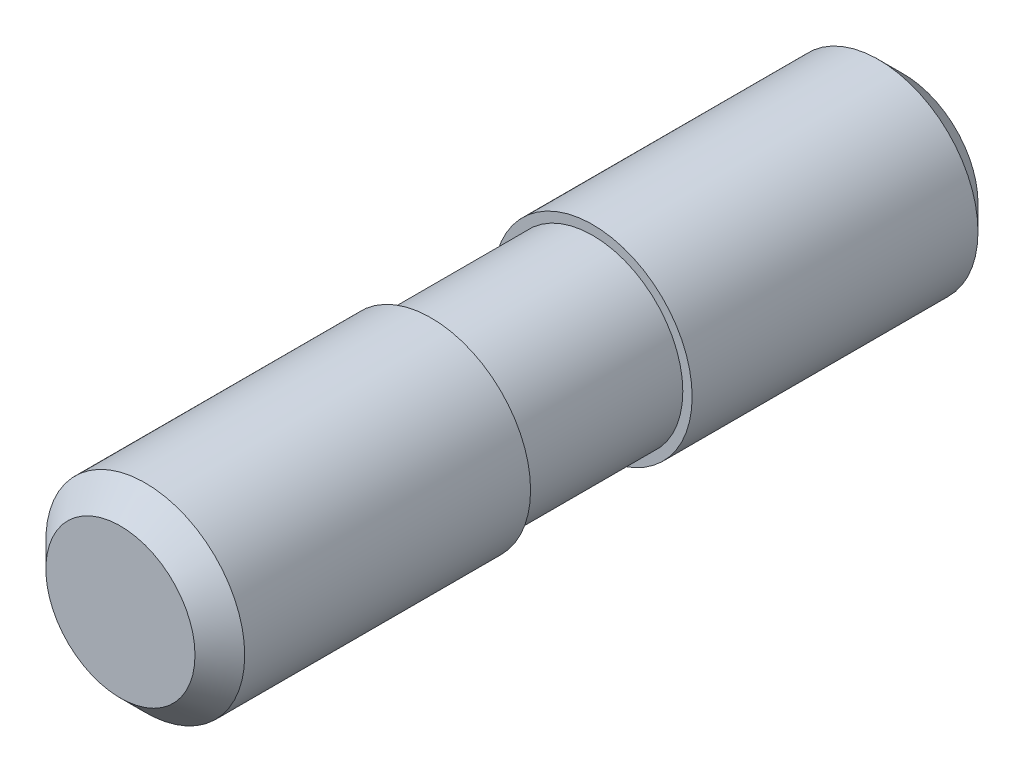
ISO-10303-21;
HEADER;
FILE_DESCRIPTION(('STEP AP214'),'2;1');
FILE_NAME('part.step','',(''),(''),'','','');
FILE_SCHEMA(('AUTOMOTIVE_DESIGN { 1 0 10303 214 1 1 1 1 }'));
ENDSEC;
DATA;
#1=APPLICATION_CONTEXT('core data for automotive mechanical design processes');
#2=APPLICATION_PROTOCOL_DEFINITION('international standard','automotive_design',2000,#1);
#3=PRODUCT_CONTEXT('',#1,'mechanical');
#4=PRODUCT('Part','Part','',(#3));
#5=PRODUCT_RELATED_PRODUCT_CATEGORY('part','',(#4));
#6=PRODUCT_DEFINITION_FORMATION('','',#4);
#7=PRODUCT_DEFINITION_CONTEXT('part definition',#1,'design');
#8=PRODUCT_DEFINITION('design','',#6,#7);
#9=PRODUCT_DEFINITION_SHAPE('','',#8);
#10=(LENGTH_UNIT() NAMED_UNIT(*) SI_UNIT(.MILLI.,.METRE.));
#11=(NAMED_UNIT(*) PLANE_ANGLE_UNIT() SI_UNIT($,.RADIAN.));
#12=(NAMED_UNIT(*) SI_UNIT($,.STERADIAN.) SOLID_ANGLE_UNIT());
#13=UNCERTAINTY_MEASURE_WITH_UNIT(LENGTH_MEASURE(1.E-05),#10,'distance_accuracy_value','');
#14=(GEOMETRIC_REPRESENTATION_CONTEXT(3) GLOBAL_UNCERTAINTY_ASSIGNED_CONTEXT((#13)) GLOBAL_UNIT_ASSIGNED_CONTEXT((#10,
#11,#12)) REPRESENTATION_CONTEXT('',''));
#15=CARTESIAN_POINT('',(0.,0.,0.));
#16=DIRECTION('',(0.,0.,1.));
#17=DIRECTION('',(1.,0.,0.));
#18=AXIS2_PLACEMENT_3D('',#15,#16,#17);
#19=CARTESIAN_POINT('',(0.,0.,0.));
#20=DIRECTION('',(0.,0.,1.));
#21=DIRECTION('',(1.,0.,0.));
#22=AXIS2_PLACEMENT_3D('',#19,#20,#21);
#23=PLANE('',#22);
#24=CARTESIAN_POINT('',(0.,0.,0.));
#25=DIRECTION('',(0.,0.,1.));
#26=DIRECTION('',(1.,0.,0.));
#27=AXIS2_PLACEMENT_3D('',#24,#25,#26);
#28=CIRCLE('',#27,6.);
#29=CARTESIAN_POINT('',(6.,0.,0.));
#30=VERTEX_POINT('',#29);
#31=EDGE_CURVE('E8',#30,#30,#28,.T.);
#32=ORIENTED_EDGE('',*,*,#31,.F.);
#33=EDGE_LOOP('',(#32));
#34=FACE_BOUND('',#33,.T.);
#35=ADVANCED_FACE('F12',(#34),#23,.F.);
#36=CARTESIAN_POINT('',(0.,0.,2.));
#37=DIRECTION('',(0.,0.,1.));
#38=DIRECTION('',(1.,0.,0.));
#39=AXIS2_PLACEMENT_3D('',#36,#37,#38);
#40=CONICAL_SURFACE('',#39,8.,0.785398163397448);
#41=ORIENTED_EDGE('',*,*,#31,.T.);
#42=EDGE_LOOP('',(#41));
#43=FACE_BOUND('',#42,.T.);
#44=CARTESIAN_POINT('',(0.,0.,2.));
#45=DIRECTION('',(0.,0.,1.));
#46=DIRECTION('',(1.,0.,0.));
#47=AXIS2_PLACEMENT_3D('',#44,#45,#46);
#48=CIRCLE('',#47,8.);
#49=CARTESIAN_POINT('',(8.,0.,2.));
#50=VERTEX_POINT('',#49);
#51=EDGE_CURVE('E18',#50,#50,#48,.T.);
#52=ORIENTED_EDGE('',*,*,#51,.F.);
#53=EDGE_LOOP('',(#52));
#54=FACE_BOUND('',#53,.T.);
#55=ADVANCED_FACE('F61',(#43,#54),#40,.T.);
#56=CARTESIAN_POINT('',(0.,0.,70.));
#57=DIRECTION('',(0.,0.,1.));
#58=DIRECTION('',(1.,0.,0.));
#59=AXIS2_PLACEMENT_3D('',#56,#57,#58);
#60=CYLINDRICAL_SURFACE('',#59,8.);
#61=CARTESIAN_POINT('',(0.,0.,25.));
#62=DIRECTION('',(0.,0.,1.));
#63=DIRECTION('',(1.,0.,0.));
#64=AXIS2_PLACEMENT_3D('',#61,#62,#63);
#65=CIRCLE('',#64,8.);
#66=CARTESIAN_POINT('',(8.,0.,25.));
#67=VERTEX_POINT('',#66);
#68=EDGE_CURVE('E22',#67,#67,#65,.T.);
#69=ORIENTED_EDGE('',*,*,#68,.F.);
#70=EDGE_LOOP('',(#69));
#71=FACE_BOUND('',#70,.T.);
#72=ORIENTED_EDGE('',*,*,#51,.T.);
#73=EDGE_LOOP('',(#72));
#74=FACE_BOUND('',#73,.T.);
#75=ADVANCED_FACE('F66',(#71,#74),#60,.T.);
#76=CARTESIAN_POINT('',(8.,0.,25.));
#77=DIRECTION('',(0.,0.,-1.));
#78=DIRECTION('',(-1.,0.,0.));
#79=AXIS2_PLACEMENT_3D('',#76,#77,#78);
#80=PLANE('',#79);
#81=CARTESIAN_POINT('',(0.,0.,25.));
#82=DIRECTION('',(0.,0.,1.));
#83=DIRECTION('',(1.,0.,0.));
#84=AXIS2_PLACEMENT_3D('',#81,#82,#83);
#85=CIRCLE('',#84,7.25);
#86=CARTESIAN_POINT('',(7.25,0.,25.));
#87=VERTEX_POINT('',#86);
#88=EDGE_CURVE('E26',#87,#87,#85,.T.);
#89=ORIENTED_EDGE('',*,*,#88,.F.);
#90=EDGE_LOOP('',(#89));
#91=FACE_BOUND('',#90,.T.);
#92=ORIENTED_EDGE('',*,*,#68,.T.);
#93=EDGE_LOOP('',(#92));
#94=FACE_BOUND('',#93,.T.);
#95=ADVANCED_FACE('F70',(#91,#94),#80,.F.);
#96=CARTESIAN_POINT('',(0.,0.,70.));
#97=DIRECTION('',(0.,0.,1.));
#98=DIRECTION('',(1.,0.,0.));
#99=AXIS2_PLACEMENT_3D('',#96,#97,#98);
#100=CYLINDRICAL_SURFACE('',#99,7.25);
#101=CARTESIAN_POINT('',(0.,0.,38.));
#102=DIRECTION('',(0.,0.,1.));
#103=DIRECTION('',(1.,0.,0.));
#104=AXIS2_PLACEMENT_3D('',#101,#102,#103);
#105=CIRCLE('',#104,7.25);
#106=CARTESIAN_POINT('',(7.25,0.,38.));
#107=VERTEX_POINT('',#106);
#108=EDGE_CURVE('E31',#107,#107,#105,.T.);
#109=ORIENTED_EDGE('',*,*,#108,.F.);
#110=EDGE_LOOP('',(#109));
#111=FACE_BOUND('',#110,.T.);
#112=ORIENTED_EDGE('',*,*,#88,.T.);
#113=EDGE_LOOP('',(#112));
#114=FACE_BOUND('',#113,.T.);
#115=ADVANCED_FACE('F77',(#111,#114),#100,.T.);
#116=CARTESIAN_POINT('',(7.25,0.,38.));
#117=DIRECTION('',(0.,0.,1.));
#118=DIRECTION('',(1.,0.,0.));
#119=AXIS2_PLACEMENT_3D('',#116,#117,#118);
#120=PLANE('',#119);
#121=CARTESIAN_POINT('',(0.,0.,38.));
#122=DIRECTION('',(0.,0.,1.));
#123=DIRECTION('',(1.,0.,0.));
#124=AXIS2_PLACEMENT_3D('',#121,#122,#123);
#125=CIRCLE('',#124,8.);
#126=CARTESIAN_POINT('',(8.,0.,38.));
#127=VERTEX_POINT('',#126);
#128=EDGE_CURVE('E34',#127,#127,#125,.T.);
#129=ORIENTED_EDGE('',*,*,#128,.F.);
#130=EDGE_LOOP('',(#129));
#131=FACE_BOUND('',#130,.T.);
#132=ORIENTED_EDGE('',*,*,#108,.T.);
#133=EDGE_LOOP('',(#132));
#134=FACE_BOUND('',#133,.T.);
#135=ADVANCED_FACE('F57',(#131,#134),#120,.F.);
#136=CARTESIAN_POINT('',(0.,0.,70.));
#137=DIRECTION('',(0.,0.,1.));
#138=DIRECTION('',(1.,0.,0.));
#139=AXIS2_PLACEMENT_3D('',#136,#137,#138);
#140=CYLINDRICAL_SURFACE('',#139,8.);
#141=CARTESIAN_POINT('',(0.,0.,61.));
#142=DIRECTION('',(0.,0.,1.));
#143=DIRECTION('',(1.,0.,0.));
#144=AXIS2_PLACEMENT_3D('',#141,#142,#143);
#145=CIRCLE('',#144,8.);
#146=CARTESIAN_POINT('',(8.,0.,61.));
#147=VERTEX_POINT('',#146);
#148=EDGE_CURVE('E37',#147,#147,#145,.T.);
#149=ORIENTED_EDGE('',*,*,#148,.F.);
#150=EDGE_LOOP('',(#149));
#151=FACE_BOUND('',#150,.T.);
#152=ORIENTED_EDGE('',*,*,#128,.T.);
#153=EDGE_LOOP('',(#152));
#154=FACE_BOUND('',#153,.T.);
#155=ADVANCED_FACE('F48',(#151,#154),#140,.T.);
#156=CARTESIAN_POINT('',(0.,0.,63.));
#157=DIRECTION('',(0.,0.,-1.));
#158=DIRECTION('',(-1.,0.,0.));
#159=AXIS2_PLACEMENT_3D('',#156,#157,#158);
#160=CONICAL_SURFACE('',#159,6.,0.785398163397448);
#161=ORIENTED_EDGE('',*,*,#148,.T.);
#162=EDGE_LOOP('',(#161));
#163=FACE_BOUND('',#162,.T.);
#164=CARTESIAN_POINT('',(0.,0.,63.));
#165=DIRECTION('',(0.,0.,1.));
#166=DIRECTION('',(1.,0.,0.));
#167=AXIS2_PLACEMENT_3D('',#164,#165,#166);
#168=CIRCLE('',#167,6.);
#169=CARTESIAN_POINT('',(6.,0.,63.));
#170=VERTEX_POINT('',#169);
#171=EDGE_CURVE('E40',#170,#170,#168,.T.);
#172=ORIENTED_EDGE('',*,*,#171,.F.);
#173=EDGE_LOOP('',(#172));
#174=FACE_BOUND('',#173,.T.);
#175=ADVANCED_FACE('F46',(#163,#174),#160,.T.);
#176=CARTESIAN_POINT('',(6.,0.,63.));
#177=DIRECTION('',(0.,0.,-1.));
#178=DIRECTION('',(-1.,0.,0.));
#179=AXIS2_PLACEMENT_3D('',#176,#177,#178);
#180=PLANE('',#179);
#181=ORIENTED_EDGE('',*,*,#171,.T.);
#182=EDGE_LOOP('',(#181));
#183=FACE_BOUND('',#182,.T.);
#184=ADVANCED_FACE('F44',(#183),#180,.F.);
#185=CLOSED_SHELL('',(#35,#55,#75,#95,#115,#135,#155,#175,#184));
#186=MANIFOLD_SOLID_BREP('B1',#185);
#187=ADVANCED_BREP_SHAPE_REPRESENTATION('',(#18,#186),#14);
#188=SHAPE_DEFINITION_REPRESENTATION(#9,#187);
ENDSEC;
END-ISO-10303-21;
